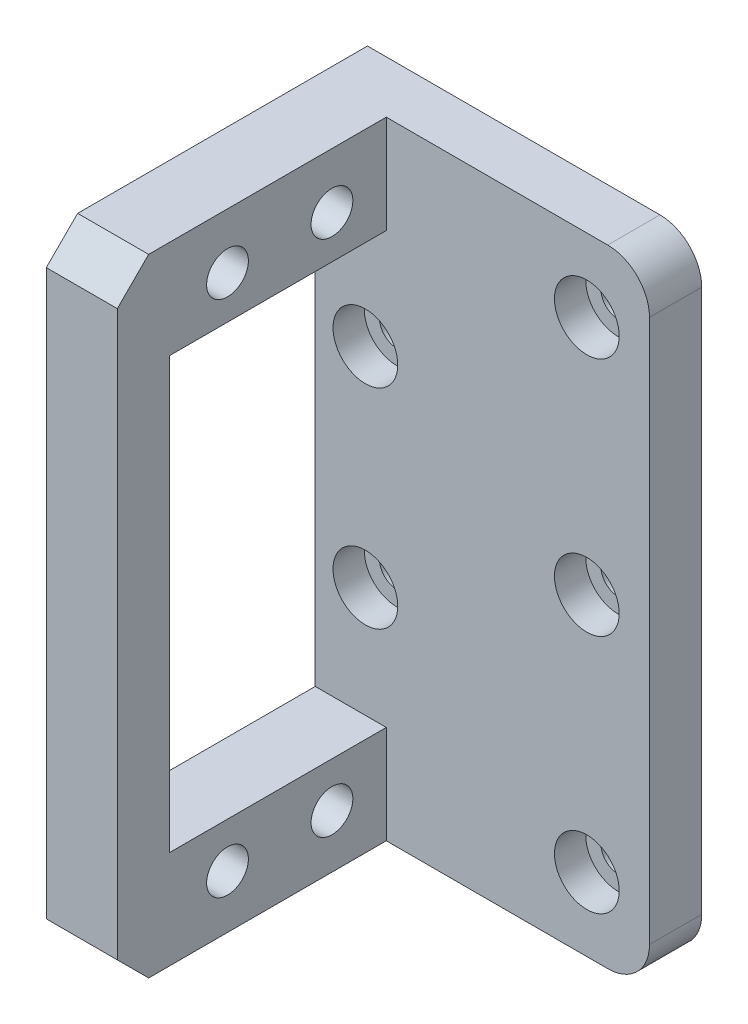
from build123d import *

# Parameters (mm, degrees)
SKETCH_1_W          = 32
SKETCH_1_H          = 60
EXTRUDE_1_DEPTH     = 5
SKETCH_2_W          = 6.8
SKETCH_2_H          = 9.4
EXTRUDE_2_DEPTH     = 19.55
SKETCH_3_R          = 2
CUT_EXTRUDE_1_DEPTH = 6.8
SKETCH_4_R          = 1.65
CUT_EXTRUDE_2_DEPTH = 5
FILLET_1_R          = 4
SKETCH_6_R          = 3.1
CUT_EXTRUDE_4_DEPTH = 3
SKETCH_7_W          = 6.8
SKETCH_7_H          = 9.4
EXTRUDE_3_DEPTH     = 1.2
SKETCH_8_W          = 5
SKETCH_8_H          = 60
EXTRUDE_4_DEPTH     = 6.8
CHAMFER_2_SIZE      = 3


with BuildPart() as part:
    # Sketch 1 → Extrude 1 (new body)
    with BuildSketch(Plane.XY):
        with Locations((-1.5, -30)):
            Rectangle(SKETCH_1_W, SKETCH_1_H)
    extrude(amount=EXTRUDE_1_DEPTH)

    # Sketch 2 → Extrude 2 (add)
    with BuildSketch(Plane.XY.offset(5)):
        with Locations((-14.1, -4.7)):
            Rectangle(SKETCH_2_W, SKETCH_2_H)
        with Locations((-14.1, -55.3)):
            Rectangle(SKETCH_2_W, SKETCH_2_H)
    extrude(amount=EXTRUDE_2_DEPTH)

    # Sketch 3 → Cut-Extrude 1 (cut)
    with BuildSketch(Plane.ZY.offset(17.5)):
        with Locations((10.2, -54.9)):
            Circle(SKETCH_3_R)
        with Locations((20.2, -54.9)):
            Circle(SKETCH_3_R)
        with Locations((20.2, -5.3)):
            Circle(SKETCH_3_R)
        with Locations((10.2, -5.3)):
            Circle(SKETCH_3_R)
    extrude(amount=-CUT_EXTRUDE_1_DEPTH, mode=Mode.SUBTRACT)

    # Sketch 4 → Cut-Extrude 2 (cut)
    with BuildSketch(Plane.XY.offset(5)):
        with Locations((-12.7, -20)):
            Circle(SKETCH_4_R)
        with Locations((-12.7, -40)):
            Circle(SKETCH_4_R)
        with Locations((8.5, -7)):
            Circle(SKETCH_4_R)
        with Locations((8.5, -53)):
            Circle(SKETCH_4_R)
        with Locations((8.5, -30)):
            Circle(SKETCH_4_R)
    extrude(amount=-CUT_EXTRUDE_2_DEPTH, mode=Mode.SUBTRACT)

    # Fillet 1
    fillet_1_edges = [part.edges().sort_by_distance(p)[0] for p in [
        (14.5, 0, 2.5),
        (14.5, -60, 2.5),
    ]]
    fillet(fillet_1_edges, radius=FILLET_1_R)

    # Sketch 6 → Cut-Extrude 4 (cut)
    with BuildSketch(Plane.XY.offset(5)):
        with Locations((-12.7, -20)):
            Circle(SKETCH_6_R)
        with Locations((8.5, -7)):
            Circle(SKETCH_6_R)
        with Locations((8.5, -30)):
            Circle(SKETCH_6_R)
        with Locations((-12.7, -40)):
            Circle(SKETCH_6_R)
        with Locations((8.5, -53)):
            Circle(SKETCH_6_R)
    extrude(amount=-CUT_EXTRUDE_4_DEPTH, mode=Mode.SUBTRACT)

    # Sketch 7 → Extrude 3 (add)
    with BuildSketch(Plane.XY.offset(24.55)):
        with Locations((-14.1, -4.7)):
            Rectangle(SKETCH_7_W, SKETCH_7_H)
        with Locations((-14.1, -55.3)):
            Rectangle(SKETCH_7_W, SKETCH_7_H)
    extrude(amount=EXTRUDE_3_DEPTH)

    # Sketch 8 → Extrude 4 (add)
    with BuildSketch(Plane.ZY.offset(17.5)):
        with Locations((28.25, -30)):
            Rectangle(SKETCH_8_W, SKETCH_8_H)
    extrude(amount=-EXTRUDE_4_DEPTH)

    # Chamfer 2
    chamfer_2_edges = [part.edges().sort_by_distance(p)[0] for p in [
        (-14.1, 0, 30.75),
        (-14.1, -60, 30.75),
    ]]
    chamfer(chamfer_2_edges, length=CHAMFER_2_SIZE)


solid = part.part
